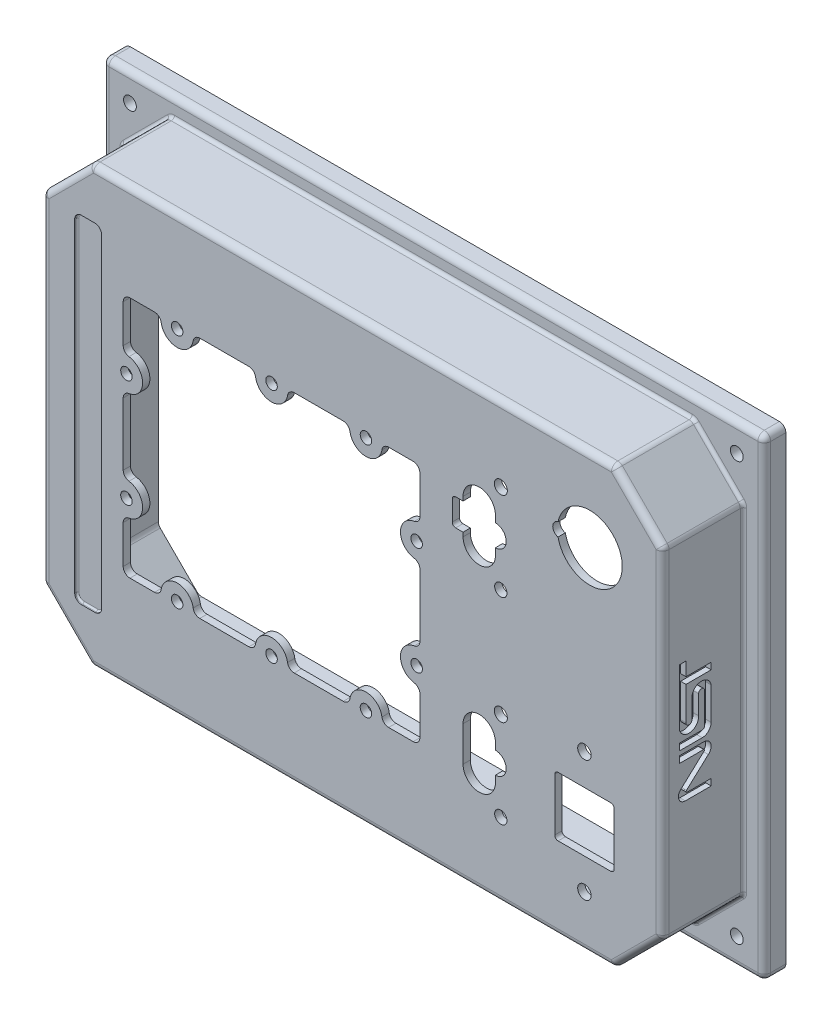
from build123d import *

# Parameters (mm, degrees)
SKETCH1_W                        = 311.6072
SKETCH1_H                        = 222.7072
BOSS_EXTRUDE1_DEPTH              = 10.16
BOSS_EXTRUDE2_DEPTH              = 38.1
F_15_64_0_23438_DIAMETER_HOLE1_D = 6.0325
LPATTERN1_COUNT                  = 2
LPATTERN1_PITCH                  = 285.75
LPATTERN1_COUNT_DIR2             = 2
LPATTERN1_PITCH_DIR2             = 196.85
CUT_EXTRUDE1_DEPTH               = 44.831
CUT_EXTRUDE2_DEPTH               = 198.492819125
F_1_4_0_25_DIAMETER_HOLE1_D      = 5.4102
LPATTERN2_COUNT                  = 3
LPATTERN2_PITCH                  = 44.45
LPATTERN2_COUNT_DIR2             = 2
LPATTERN2_PITCH_DIR2             = 111.252
F_1_4_0_25_DIAMETER_HOLE2_D      = 5.4102
LPATTERN3_COUNT                  = 2
LPATTERN3_PITCH                  = 136.652
LPATTERN3_COUNT_DIR2             = 2
LPATTERN3_PITCH_DIR2             = 50.8
SKETCH15_W                       = 27.94
SKETCH15_H                       = 27.94
CUT_EXTRUDE3_DEPTH               = 44.831
F_1_4_0_25_DIAMETER_HOLE3_D      = 6.35
LPATTERN4_COUNT                  = 2
LPATTERN4_PITCH                  = 57.15
F_1_4_0_25_DIAMETER_HOLE4_D      = 5.7912
LPATTERN5_COUNT                  = 2
LPATTERN5_PITCH                  = 92.71
F_1_4_0_25_DIAMETER_HOLE5_D      = 6.1468
LPATTERN6_COUNT                  = 2
LPATTERN6_PITCH                  = 92.71
CUT_EXTRUDE4_DEPTH               = 44.831
SKETCH23_W                       = 12.7
SKETCH23_H                       = 158.75
CUT_EXTRUDE5_DEPTH               = 1.27
CUT_EXTRUDE6_REACH               = 199.493
FILLET1_R                        = 3.175
FILLET2_R                        = 3.175
FILLET3_R                        = 0.762
FILLET4_R                        = 1.5875
FILLET5_R                        = 1.5875
FILLET7_R                        = 3.048
FILLET6_R                        = 1.524
FILLET8_R                        = 3.048
FILLET9_R                        = 3.048
CUT_EXTRUDE7_DEPTH               = 2.54


with BuildPart() as part:
    # Sketch1 → Boss-Extrude1 (new body)
    with BuildSketch(Plane.XY):
        Rectangle(SKETCH1_W, SKETCH1_H)
    extrude(amount=BOSS_EXTRUDE1_DEPTH)

    # Sketch2 → Boss-Extrude2 (add)
    with BuildSketch(Plane.XY.offset(10.16)):
        Polygon((-123.1646, 102.4636), (123.1646, 102.4636), (146.0246, 79.6036), (146.0246, -79.6036), (123.1646, -102.4636), (-123.1646, -102.4636), (-146.0246, -79.6036), (-146.0246, 79.6036), align=None)
    extrude(amount=BOSS_EXTRUDE2_DEPTH)

    # 15_64 _0.23438_ Diameter Hole1 (through all)
    with Locations(Plane.XY.offset(10.16)):
        with Locations((-142.875, 98.425)):
            f_15_64_0_23438_diameter_hole1 = Hole(F_15_64_0_23438_DIAMETER_HOLE1_D / 2)

    # LPattern1: 15_64 _0.23438_ Diameter Hole1 2 × 2
    with Locations(*[(i * LPATTERN1_PITCH, -j * LPATTERN1_PITCH_DIR2, 0) for i in range(LPATTERN1_COUNT) for j in range(LPATTERN1_COUNT_DIR2) if (i, j) != (0, 0)]):
        add(f_15_64_0_23438_diameter_hole1, mode=Mode.SUBTRACT)

    # Sketch9 → Cut-Extrude1 (cut)
    with BuildSketch(Plane.XY):
        Polygon((-120.534343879, 96.1136), (-139.6746, 76.973343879), (-139.6746, -76.973343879), (-120.534343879, -96.1136), (120.534343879, -96.1136), (139.6746, -76.973343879), (139.6746, 76.973343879), (120.534343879, 96.1136), align=None)
    extrude(amount=CUT_EXTRUDE1_DEPTH, mode=Mode.SUBTRACT)

    # Sketch10 → Cut-Extrude2 (cut, through all)
    with BuildSketch(Plane.XY.offset(48.26)):
        with BuildLine():
            Line((-45.72, -55.626), (-45.72, -57.15))
            Line((-45.72, -57.15), (-74.93, -57.15))
            Line((-74.93, -57.15), (-74.93, -55.626))
            ThreePointArc((-74.93, -55.626), (-82.55, -48.006), (-90.17, -55.626))
            Line((-90.17, -55.626), (-90.17, -57.15))
            Line((-90.17, -57.15), (-107.95, -57.15))
            Line((-107.95, -57.15), (-107.95, -33.02))
            Line((-107.95, -33.02), (-106.426, -33.02))
            ThreePointArc((-106.426, -33.02), (-98.806, -25.4), (-106.426, -17.78))
            Line((-106.426, -17.78), (-107.95, -17.78))
            Line((-107.95, -17.78), (-107.95, 17.78))
            Line((-107.95, 17.78), (-106.426, 17.78))
            ThreePointArc((-106.426, 17.78), (-98.806, 25.4), (-106.426, 33.02))
            Line((-106.426, 33.02), (-107.95, 33.02))
            Line((-107.95, 33.02), (-107.95, 57.15))
            Line((-107.95, 57.15), (-90.17, 57.15))
            Line((-90.17, 57.15), (-90.17, 55.626))
            ThreePointArc((-90.17, 55.626), (-82.55, 48.006), (-74.93, 55.626))
            Line((-74.93, 55.626), (-74.93, 57.15))
            Line((-74.93, 57.15), (-45.72, 57.15))
            Line((-45.72, 57.15), (-45.72, 55.626))
            ThreePointArc((-45.72, 55.626), (-38.1, 48.006), (-30.48, 55.626))
            Line((-30.48, 55.626), (-30.48, 57.15))
            Line((-30.48, 57.15), (-1.27, 57.15))
            Line((-1.27, 57.15), (-1.27, 55.626))
            ThreePointArc((-1.27, 55.626), (6.35, 48.006), (13.97, 55.626))
            Line((13.97, 55.626), (13.97, 57.15))
            Line((13.97, 57.15), (31.75, 57.15))
            Line((31.75, 57.15), (31.75, 33.02))
            Line((31.75, 33.02), (30.226, 33.02))
            ThreePointArc((30.226, 33.02), (22.606, 25.4), (30.226, 17.78))
            Line((30.226, 17.78), (31.75, 17.78))
            Line((31.75, 17.78), (31.75, -17.78))
            Line((31.75, -17.78), (30.226, -17.78))
            ThreePointArc((30.226, -17.78), (22.606, -25.4), (30.226, -33.02))
            Line((30.226, -33.02), (31.75, -33.02))
            Line((31.75, -33.02), (31.75, -57.15))
            Line((31.75, -57.15), (13.97, -57.15))
            Line((13.97, -57.15), (13.97, -55.626))
            ThreePointArc((13.97, -55.626), (6.35, -48.006), (-1.27, -55.626))
            Line((-1.27, -55.626), (-1.27, -57.15))
            Line((-1.27, -57.15), (-30.48, -57.15))
            Line((-30.48, -57.15), (-30.48, -55.626))
            ThreePointArc((-30.48, -55.626), (-38.1, -48.006), (-45.72, -55.626))
        make_face()
    extrude(amount=-CUT_EXTRUDE2_DEPTH, mode=Mode.SUBTRACT)

    # 1_4 _0.25_ Diameter Hole1 (through all)
    with Locations(Plane.XY.offset(48.26)):
        with Locations((-82.55, 55.626)):
            f_1_4_0_25_diameter_hole1 = Hole(F_1_4_0_25_DIAMETER_HOLE1_D / 2)

    # LPattern2: 1_4 _0.25_ Diameter Hole1 3 × 2
    with Locations(*[(i * LPATTERN2_PITCH, -j * LPATTERN2_PITCH_DIR2, 0) for i in range(LPATTERN2_COUNT) for j in range(LPATTERN2_COUNT_DIR2) if (i, j) != (0, 0)]):
        add(f_1_4_0_25_diameter_hole1, mode=Mode.SUBTRACT)

    # 1_4 _0.25_ Diameter Hole2 (through all)
    with Locations(Plane.XY.offset(48.26)):
        with Locations((-106.426, 25.4)):
            f_1_4_0_25_diameter_hole2 = Hole(F_1_4_0_25_DIAMETER_HOLE2_D / 2)

    # LPattern3: 1_4 _0.25_ Diameter Hole2 2 × 2
    with Locations(*[(i * LPATTERN3_PITCH, -j * LPATTERN3_PITCH_DIR2, 0) for i in range(LPATTERN3_COUNT) for j in range(LPATTERN3_COUNT_DIR2) if (i, j) != (0, 0)]):
        add(f_1_4_0_25_diameter_hole2, mode=Mode.SUBTRACT)

    # Sketch15 → Cut-Extrude3 (cut)
    with BuildSketch(Plane.XY.offset(48.26)):
        with Locations((109.22, -49.53)):
            Rectangle(SKETCH15_W, SKETCH15_H)
    extrude(amount=-CUT_EXTRUDE3_DEPTH, mode=Mode.SUBTRACT)

    # 1_4 _0.25_ Diameter Hole3 (through all)
    with Locations(Plane.XY.offset(48.26)):
        with Locations((109.22, -20.955)):
            f_1_4_0_25_diameter_hole3 = Hole(F_1_4_0_25_DIAMETER_HOLE3_D / 2)

    # LPattern4: 1_4 _0.25_ Diameter Hole3 ×2
    with Locations(*[(0, -i * LPATTERN4_PITCH, 0) for i in range(1, LPATTERN4_COUNT)]):
        add(f_1_4_0_25_diameter_hole3, mode=Mode.SUBTRACT)

    # 1_4 _0.25_ Diameter Hole4 (through all)
    with Locations(Plane.XY.offset(48.26)):
        with Locations((69.85, 25.4)):
            f_1_4_0_25_diameter_hole4 = Hole(F_1_4_0_25_DIAMETER_HOLE4_D / 2)

    # LPattern5: 1_4 _0.25_ Diameter Hole4 ×2
    with Locations(*[(0, -i * LPATTERN5_PITCH, 0) for i in range(1, LPATTERN5_COUNT)]):
        add(f_1_4_0_25_diameter_hole4, mode=Mode.SUBTRACT)

    # 1_4 _0.25_ Diameter Hole5 (through all)
    with Locations(Plane.XY.offset(48.26)):
        with Locations((69.85, 67.31)):
            f_1_4_0_25_diameter_hole5 = Hole(F_1_4_0_25_DIAMETER_HOLE5_D / 2)

    # LPattern6: 1_4 _0.25_ Diameter Hole5 ×2
    with Locations(*[(0, -i * LPATTERN6_PITCH, 0) for i in range(1, LPATTERN6_COUNT)]):
        add(f_1_4_0_25_diameter_hole5, mode=Mode.SUBTRACT)

    # Sketch22 → Cut-Extrude4 (cut)
    with BuildSketch(Plane.XY.offset(48.26)):
        with BuildLine():
            Line((67.31, 54.61), (67.31, 51.435))
            ThreePointArc((67.31, 51.435), (72.39, 46.355), (67.31, 41.275))
            Line((67.31, 41.275), (67.31, 38.1))
            ThreePointArc((67.31, 38.1), (59.69, 30.48), (52.07, 38.1))
            Line((52.07, 38.1), (52.07, 40.005))
            Line((52.07, 40.005), (46.99, 40.005))
            Line((46.99, 40.005), (46.99, 52.705))
            Line((46.99, 52.705), (52.07, 52.705))
            Line((52.07, 52.705), (52.07, 54.61))
            ThreePointArc((52.07, 54.61), (59.69, 62.23), (67.31, 54.61))
        make_face()
        with BuildLine():
            Line((67.31, -41.275), (67.31, -38.1))
            ThreePointArc((67.31, -38.1), (59.69, -30.48), (52.07, -38.1))
            Line((52.07, -38.1), (52.07, -54.61))
            ThreePointArc((52.07, -54.61), (59.69, -62.23), (67.31, -54.61))
            Line((67.31, -54.61), (67.31, -51.435))
            ThreePointArc((67.31, -51.435), (72.39, -46.355), (67.31, -41.275))
        make_face()
    extrude(amount=-CUT_EXTRUDE4_DEPTH, mode=Mode.SUBTRACT)

    # Sketch23 → Cut-Extrude5 (cut)
    with BuildSketch(Plane.XY.offset(48.26)):
        with Locations((-124.46, 0)):
            Rectangle(SKETCH23_W, SKETCH23_H)
    extrude(amount=-CUT_EXTRUDE5_DEPTH, mode=Mode.SUBTRACT)

    # Sketch24 → Cut-Extrude6 (cut, up to next)
    with BuildSketch(Plane.XY.offset(48.26), mode=Mode.PRIVATE) as cut_extrude6_sk1:
        with BuildLine():
            ThreePointArc((96.798978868, 60.397260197), (127.03937, 63.5), (96.798978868, 66.602739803))
            ThreePointArc((96.798978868, 66.602739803), (94.2975, 63.5), (96.798978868, 60.397260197))
        make_face()
    cut_extrude6_tool1 = extrude(cut_extrude6_sk1.sketch, amount=-CUT_EXTRUDE6_REACH, mode=Mode.PRIVATE) & part.part
    add(cut_extrude6_tool1.solids().sort_by_distance((111.53734, 63.5, 48.26))[0], mode=Mode.SUBTRACT)

    # Fillet1
    fillet1_edges = [part.edges().sort_by_distance(p)[0] for p in [
        (-107.95, -57.15, 46.5455),
        (-74.93, -57.15, 46.5455),
        (-90.17, -57.15, 46.5455),
        (-45.72, -57.15, 46.5455),
        (-1.27, -57.15, 46.5455),
        (-30.48, -57.15, 46.5455),
        (13.97, -57.15, 46.5455),
        (31.75, -57.15, 46.5455),
        (31.75, 33.02, 46.5455),
        (31.75, -17.78, 46.5455),
        (31.75, -33.02, 46.5455),
        (31.75, 17.78, 46.5455),
        (-90.17, 57.15, 46.5455),
        (-45.72, 57.15, 46.5455),
        (-1.27, 57.15, 46.5455),
        (31.75, 57.15, 46.5455),
        (-107.95, 33.02, 46.5455),
        (-107.95, -17.78, 46.5455),
        (-107.95, -33.02, 46.5455),
        (-107.95, 17.78, 46.5455),
        (13.97, 57.15, 46.5455),
        (-30.48, 57.15, 46.5455),
        (-74.93, 57.15, 46.5455),
        (-107.95, 57.15, 46.5455),
    ]]
    fillet(fillet1_edges, radius=FILLET1_R)

    # Fillet2
    fillet2_edges = [part.edges().sort_by_distance(p)[0] for p in [
        (-130.81, -79.375, 47.625),
        (-130.81, 79.375, 47.625),
        (-118.11, 79.375, 47.625),
        (-118.11, -79.375, 47.625),
    ]]
    fillet(fillet2_edges, radius=FILLET2_R)

    # Fillet3
    fillet3_edges = [part.edges().sort_by_distance(p)[0] for p in [
        (-124.46, -79.375, 46.99),
        (-130.81, 0, 46.99),
        (-118.11, 0, 46.99),
        (-124.46, 79.375, 46.99),
        (-129.88006403, 78.44506403, 46.99),
        (-119.03993597, 78.44506403, 46.99),
        (-119.03993597, -78.44506403, 46.99),
        (-129.88006403, -78.44506403, 46.99),
    ]]
    fillet(fillet3_edges, radius=FILLET3_R)

    # Fillet4
    fillet4_edges = [part.edges().sort_by_distance(p)[0] for p in [
        (46.99, 40.005, 46.5455),
        (46.99, 52.705, 46.5455),
    ]]
    fillet(fillet4_edges, radius=FILLET4_R)

    # Fillet5
    fillet5_edges = [part.edges().sort_by_distance(p)[0] for p in [
        (95.25, -63.5, 46.5455),
        (95.25, -35.56, 46.5455),
        (123.19, -35.56, 46.5455),
        (123.19, -63.5, 46.5455),
    ]]
    fillet(fillet5_edges, radius=FILLET5_R)

    # Fillet7
    fillet7_edges = [part.edges().sort_by_distance(p)[0] for p in [
        (-123.1646, 102.4636, 29.21),
        (-146.0246, 79.6036, 29.21),
        (-146.0246, -79.6036, 29.21),
        (-123.1646, -102.4636, 29.21),
        (123.1646, -102.4636, 29.21),
        (146.0246, -79.6036, 29.21),
        (146.0246, 79.6036, 29.21),
        (123.1646, 102.4636, 29.21),
        (-134.5946, 91.0336, 48.26),
        (-146.0246, 0, 48.26),
        (-134.5946, -91.0336, 48.26),
        (0, -102.4636, 48.26),
        (134.5946, -91.0336, 48.26),
        (146.0246, 0, 48.26),
        (134.5946, 91.0336, 48.26),
        (0, 102.4636, 48.26),
    ]]
    fillet(fillet7_edges, radius=FILLET7_R)

    # Fillet6
    fillet6_edges = [part.edges().sort_by_distance(p)[0] for p in [
        (134.5946, 91.0336, 10.16),
        (-134.5946, -91.0336, 10.16),
        (-146.0246, 0, 10.16),
        (0, -102.4636, 10.16),
        (134.5946, -91.0336, 10.16),
        (146.0246, 0, 10.16),
        (0, 102.4636, 10.16),
        (-134.5946, 91.0336, 10.16),
        (-145.792584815, -79.507496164, 10.16),
        (-123.068496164, -102.231584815, 10.16),
        (123.068496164, -102.231584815, 10.16),
        (145.792584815, -79.507496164, 10.16),
        (145.792584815, 79.507496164, 10.16),
        (123.068496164, 102.231584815, 10.16),
        (-123.068496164, 102.231584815, 10.16),
        (-145.792584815, 79.507496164, 10.16),
    ]]
    fillet(fillet6_edges, radius=FILLET6_R)

    # Fillet8
    fillet8_edges = [part.edges().sort_by_distance(p)[0] for p in [
        (155.8036, 0, 10.16),
        (0, 111.3536, 10.16),
        (-155.8036, 0, 10.16),
        (0, -111.3536, 10.16),
        (-155.8036, 111.3536, 5.08),
        (155.8036, 111.3536, 5.08),
        (155.8036, -111.3536, 5.08),
        (-155.8036, -111.3536, 5.08),
    ]]
    fillet(fillet8_edges, radius=FILLET8_R)

    # Fillet9
    fillet9_edges = [part.edges().sort_by_distance(p)[0] for p in [
        (120.534343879, 96.1136, 22.4155),
        (-120.534343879, 96.1136, 22.4155),
        (-139.6746, 76.973343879, 22.4155),
        (-139.6746, -76.973343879, 22.4155),
        (-120.534343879, -96.1136, 22.4155),
        (120.534343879, -96.1136, 22.4155),
        (139.6746, -76.973343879, 22.4155),
        (139.6746, 76.973343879, 22.4155),
        (0, 96.1136, 44.831),
        (-130.104471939, 86.543471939, 44.831),
        (-139.6746, 0, 44.831),
        (-130.104471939, -86.543471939, 44.831),
        (0, -96.1136, 44.831),
        (130.104471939, -86.543471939, 44.831),
        (139.6746, 0, 44.831),
        (130.104471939, 86.543471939, 44.831),
    ]]
    fillet(fillet9_edges, radius=FILLET9_R)

    # Sketch29 → Cut-Extrude7 (cut)
    with BuildSketch(Plane(origin=(146.0246, 0, 0), x_dir=(0, 0, -1), z_dir=(1, 0, 0))):
        with BuildLine():
            Line((-40.4, -6.1589015), (-29.595737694, -6.1589015))
            ThreePointArc((-29.595737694, -6.1589015), (-26.628903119, -4.929998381), (-25.4, -1.963163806))
            Line((-25.4, -1.963163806), (-25.4, 13.237322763))
            ThreePointArc((-25.4, 13.237322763), (-29.911464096, 17.08720584), (-34.422928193, 13.237322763))
            Line((-34.422928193, 13.237322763), (-34.422928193, 3.610561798))
            ThreePointArc((-34.422928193, 3.610561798), (-35.890845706, 2.20135799), (-37.238989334, 3.725544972))
            Line((-37.238989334, 3.725544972), (-37.238989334, 19.415615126))
            Line((-37.238989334, 19.415615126), (-25.4, 19.415615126))
            Line((-25.4, 19.415615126), (-25.4, 22.518107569))
            Line((-25.4, 22.518107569), (-37.238989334, 22.518107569))
            Line((-37.238989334, 22.518107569), (-37.238989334, 28.927392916))
            Line((-37.238989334, 28.927392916), (-40.4, 28.927392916))
            Line((-40.4, 28.927392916), (-40.4, 3.324130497))
            ThreePointArc((-40.4, 3.324130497), (-35.681192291, -1.219334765), (-31.31958022, 3.668053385))
            Line((-31.31958022, 3.668053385), (-31.31958022, 12.719898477))
            ThreePointArc((-31.31958022, 12.719898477), (-29.937198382, 14.013509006), (-28.503176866, 12.777390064))
            Line((-28.503176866, 12.777390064), (-28.503176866, -1.9340758))
            ThreePointArc((-28.503176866, -1.9340758), (-28.823180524, -2.70663297), (-29.595737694, -3.026636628))
            Line((-29.595737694, -3.026636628), (-40.4, -3.026636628))
            Line((-40.4, -3.026636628), (-40.4, -6.1589015))
        make_face()
        with BuildLine():
            Line((-25.4, -27.94), (-37.562091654, -27.94))
            ThreePointArc((-37.562091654, -27.94), (-40.598654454, -25.867827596), (-39.776078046, -22.284814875))
            Line((-39.776078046, -22.284814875), (-28.675651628, -12.019963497))
            ThreePointArc((-28.675651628, -12.019963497), (-28.57772605, -11.548341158), (-28.991855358, -11.302345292))
            Line((-28.991855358, -11.302345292), (-40.4, -11.302345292))
            Line((-40.4, -11.302345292), (-40.4, -8.17008042))
            Line((-40.4, -8.17008042), (-28.917141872, -8.17008042))
            ThreePointArc((-28.917141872, -8.17008042), (-25.598389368, -10.5226757), (-26.719424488, -14.433187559))
            Line((-26.719424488, -14.433187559), (-37.009022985, -23.900342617))
            ThreePointArc((-37.009022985, -23.900342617), (-37.146449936, -24.493816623), (-36.643484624, -24.837507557))
            Line((-36.643484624, -24.837507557), (-25.4, -24.837507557))
            Line((-25.4, -24.837507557), (-25.4, -27.94))
        make_face()
    extrude(amount=-CUT_EXTRUDE7_DEPTH, mode=Mode.SUBTRACT)


solid = part.part
